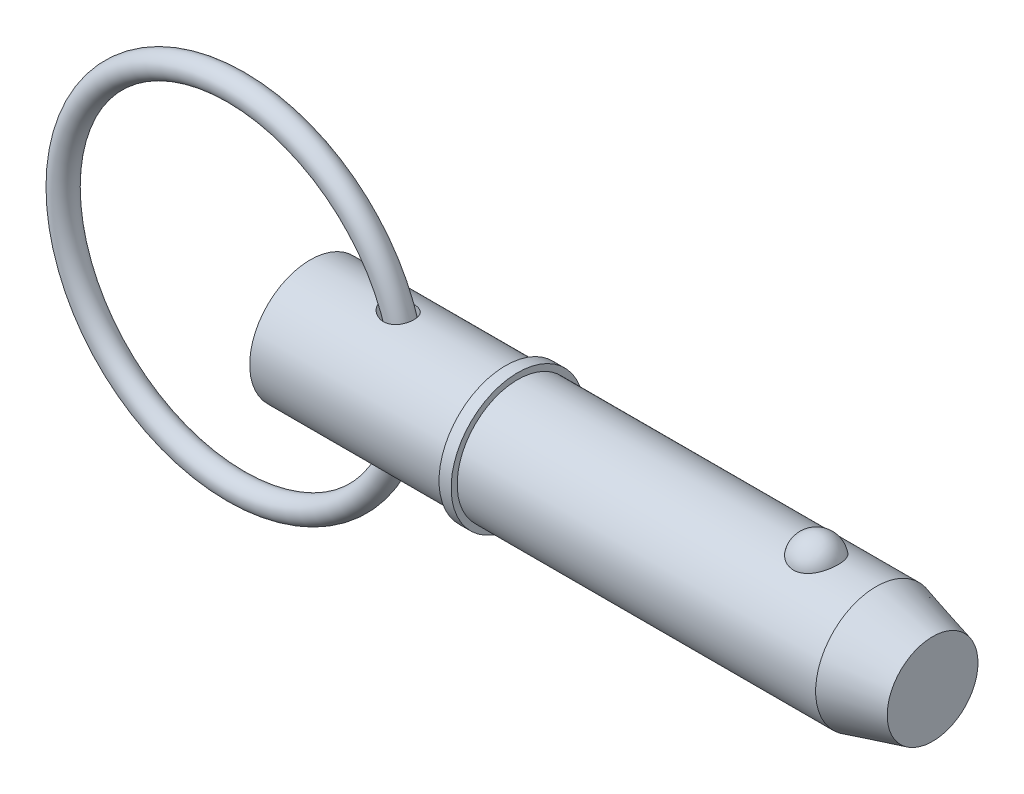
ISO-10303-21;
HEADER;
FILE_DESCRIPTION(('STEP AP214'),'2;1');
FILE_NAME('part.step','',(''),(''),'','','');
FILE_SCHEMA(('AUTOMOTIVE_DESIGN { 1 0 10303 214 1 1 1 1 }'));
ENDSEC;
DATA;
#1=APPLICATION_CONTEXT('core data for automotive mechanical design processes');
#2=APPLICATION_PROTOCOL_DEFINITION('international standard','automotive_design',2000,#1);
#3=PRODUCT_CONTEXT('',#1,'mechanical');
#4=PRODUCT('Part','Part','',(#3));
#5=PRODUCT_RELATED_PRODUCT_CATEGORY('part','',(#4));
#6=PRODUCT_DEFINITION_FORMATION('','',#4);
#7=PRODUCT_DEFINITION_CONTEXT('part definition',#1,'design');
#8=PRODUCT_DEFINITION('design','',#6,#7);
#9=PRODUCT_DEFINITION_SHAPE('','',#8);
#10=(LENGTH_UNIT() NAMED_UNIT(*) SI_UNIT(.MILLI.,.METRE.));
#11=(NAMED_UNIT(*) PLANE_ANGLE_UNIT() SI_UNIT($,.RADIAN.));
#12=(NAMED_UNIT(*) SI_UNIT($,.STERADIAN.) SOLID_ANGLE_UNIT());
#13=UNCERTAINTY_MEASURE_WITH_UNIT(LENGTH_MEASURE(1.E-05),#10,'distance_accuracy_value','');
#14=(GEOMETRIC_REPRESENTATION_CONTEXT(3) GLOBAL_UNCERTAINTY_ASSIGNED_CONTEXT((#13)) GLOBAL_UNIT_ASSIGNED_CONTEXT((#10,
#11,#12)) REPRESENTATION_CONTEXT('',''));
#15=CARTESIAN_POINT('',(0.,0.,0.));
#16=DIRECTION('',(0.,0.,1.));
#17=DIRECTION('',(1.,0.,0.));
#18=AXIS2_PLACEMENT_3D('',#15,#16,#17);
#19=CARTESIAN_POINT('',(-13.640845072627,0.,0.));
#20=DIRECTION('',(0.,0.,1.));
#21=DIRECTION('',(1.,0.,0.));
#22=AXIS2_PLACEMENT_3D('',#19,#20,#21);
#23=TOROIDAL_SURFACE('',#22,31.75,2.223);
#24=CARTESIAN_POINT('',(20.332154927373,0.,0.));
#25=VERTEX_POINT('',#24);
#26=VERTEX_LOOP('',#25);
#27=FACE_BOUND('',#26,.T.);
#28=ADVANCED_FACE('P0_F12',(#27),#23,.T.);
#29=CLOSED_SHELL('',(#28));
#30=MANIFOLD_SOLID_BREP('P0_B1',#29);
#31=CARTESIAN_POINT('',(0.,0.,0.));
#32=DIRECTION('',(1.,0.,0.));
#33=DIRECTION('',(0.,0.,-1.));
#34=AXIS2_PLACEMENT_3D('',#31,#32,#33);
#35=CYLINDRICAL_SURFACE('',#34,11.115);
#36=CARTESIAN_POINT('',(13.5245830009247,11.0328953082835,-1.34849772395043));
#37=CARTESIAN_POINT('',(13.6190616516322,11.0150940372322,-1.49413162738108));
#38=CARTESIAN_POINT('',(13.7272589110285,10.9954577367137,-1.63076546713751));
#39=CARTESIAN_POINT('',(13.9654537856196,10.9550099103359,-1.8834727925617));
#40=CARTESIAN_POINT('',(14.0954990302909,10.9341958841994,-1.99950019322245));
#41=CARTESIAN_POINT('',(14.3718600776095,10.893854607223,-2.20871939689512));
#42=CARTESIAN_POINT('',(14.5180879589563,10.8743212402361,-2.30202655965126));
#43=CARTESIAN_POINT('',(14.8233821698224,10.8385071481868,-2.46515115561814));
#44=CARTESIAN_POINT('',(14.9824448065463,10.8222254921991,-2.53497531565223));
#45=CARTESIAN_POINT('',(15.3233581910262,10.7936101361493,-2.65430007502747));
#46=CARTESIAN_POINT('',(15.5060064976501,10.7817126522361,-2.7016502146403));
#47=CARTESIAN_POINT('',(15.8771124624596,10.7657570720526,-2.76455948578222));
#48=CARTESIAN_POINT('',(16.0655695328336,10.7616981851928,-2.78012182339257));
#49=CARTESIAN_POINT('',(16.4345152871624,10.7624400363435,-2.77724928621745));
#50=CARTESIAN_POINT('',(16.6150121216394,10.7668823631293,-2.76018977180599));
#51=CARTESIAN_POINT('',(16.9695132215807,10.7837407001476,-2.69357457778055));
#52=CARTESIAN_POINT('',(17.1435222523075,10.7961507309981,-2.64404326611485));
#53=CARTESIAN_POINT('',(17.4621418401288,10.8258984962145,-2.51928348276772));
#54=CARTESIAN_POINT('',(17.6079677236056,10.8426430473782,-2.44700611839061));
#55=CARTESIAN_POINT('',(17.884162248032,10.8794194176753,-2.27791740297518));
#56=CARTESIAN_POINT('',(18.0145349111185,10.8994503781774,-2.18111245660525));
#57=CARTESIAN_POINT('',(18.2494965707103,10.9392822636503,-1.9713196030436));
#58=CARTESIAN_POINT('',(18.3550661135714,10.9590421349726,-1.85941863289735));
#59=CARTESIAN_POINT('',(18.5458147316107,10.9970986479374,-1.61919918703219));
#60=CARTESIAN_POINT('',(18.6309947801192,11.0153953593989,-1.49088149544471));
#61=CARTESIAN_POINT('',(18.7786686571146,11.0484675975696,-1.2218388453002));
#62=CARTESIAN_POINT('',(18.8412214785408,11.063252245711,-1.08114735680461));
#63=CARTESIAN_POINT('',(18.9425265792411,11.0877718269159,-0.791025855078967));
#64=CARTESIAN_POINT('',(18.9812780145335,11.0975065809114,-0.641595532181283));
#65=CARTESIAN_POINT('',(19.0343305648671,11.1109435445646,-0.336997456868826));
#66=CARTESIAN_POINT('',(19.0484404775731,11.1145985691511,-0.181794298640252));
#67=CARTESIAN_POINT('',(19.0513147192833,11.1153384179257,0.128864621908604));
#68=CARTESIAN_POINT('',(19.0400783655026,11.112423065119,0.284320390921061));
#69=CARTESIAN_POINT('',(18.9924362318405,11.1003163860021,0.591525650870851));
#70=CARTESIAN_POINT('',(18.9559600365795,11.0911075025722,0.743263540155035));
#71=CARTESIAN_POINT('',(18.858576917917,11.0673920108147,1.0382524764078));
#72=CARTESIAN_POINT('',(18.7976699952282,11.0528854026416,1.18150352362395));
#73=CARTESIAN_POINT('',(18.6529960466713,11.020201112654,1.45511394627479));
#74=CARTESIAN_POINT('',(18.5692772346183,11.0020311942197,1.58549973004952));
#75=CARTESIAN_POINT('',(18.3810003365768,10.9640237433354,1.82995492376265));
#76=CARTESIAN_POINT('',(18.2764441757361,10.9441863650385,1.94402583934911));
#77=CARTESIAN_POINT('',(18.0501398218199,10.9052267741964,2.15183128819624));
#78=CARTESIAN_POINT('',(17.9285270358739,10.8861003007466,2.24571250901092));
#79=CARTESIAN_POINT('',(17.6709592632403,10.8505244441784,2.41175942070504));
#80=CARTESIAN_POINT('',(17.5350055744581,10.8340748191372,2.48392707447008));
#81=CARTESIAN_POINT('',(17.2528390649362,10.8056099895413,2.60497667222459));
#82=CARTESIAN_POINT('',(17.1066353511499,10.7935909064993,2.65387899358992));
#83=CARTESIAN_POINT('',(16.8080326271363,10.7750969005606,2.72799859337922));
#84=CARTESIAN_POINT('',(16.6556326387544,10.7686228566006,2.75321211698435));
#85=CARTESIAN_POINT('',(16.3428877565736,10.761517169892,2.78086153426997));
#86=CARTESIAN_POINT('',(16.1824599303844,10.7611149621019,2.78240297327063));
#87=CARTESIAN_POINT('',(15.863296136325,10.766478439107,2.76156874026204));
#88=CARTESIAN_POINT('',(15.7045607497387,10.7722461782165,2.73918510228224));
#89=CARTESIAN_POINT('',(15.3787211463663,10.7898500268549,2.66904167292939));
#90=CARTESIAN_POINT('',(15.2120794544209,10.8021675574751,2.61925575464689));
#91=CARTESIAN_POINT('',(14.8886284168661,10.8315482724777,2.49496357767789));
#92=CARTESIAN_POINT('',(14.731827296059,10.8486153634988,2.42043695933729));
#93=CARTESIAN_POINT('',(14.4198762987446,10.8870804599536,2.24137362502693));
#94=CARTESIAN_POINT('',(14.2658484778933,10.9087148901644,2.13492229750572));
#95=CARTESIAN_POINT('',(13.9788214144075,10.9526299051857,1.89676517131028));
#96=CARTESIAN_POINT('',(13.8458041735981,10.9749099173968,1.76508120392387));
#97=CARTESIAN_POINT('',(13.6310853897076,11.012885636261,1.50762337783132));
#98=CARTESIAN_POINT('',(13.5444453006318,11.0290026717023,1.38602082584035));
#99=CARTESIAN_POINT('',(13.392158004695,11.0581740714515,1.12983363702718));
#100=CARTESIAN_POINT('',(13.3264946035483,11.0712307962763,0.995259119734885));
#101=CARTESIAN_POINT('',(13.2464179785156,11.0874250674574,0.785640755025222));
#102=CARTESIAN_POINT('',(13.2227369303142,11.0922707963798,0.714166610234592));
#103=CARTESIAN_POINT('',(13.1820656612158,11.1006486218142,0.569277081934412));
#104=CARTESIAN_POINT('',(13.1650721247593,11.1041813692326,0.495862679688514));
#105=CARTESIAN_POINT('',(13.1381118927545,11.1098070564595,0.347711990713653));
#106=CARTESIAN_POINT('',(13.1281436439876,11.1119003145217,0.272975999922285));
#107=CARTESIAN_POINT('',(13.1154243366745,11.1145746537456,0.122890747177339));
#108=CARTESIAN_POINT('',(13.1126723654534,11.1151559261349,0.0475415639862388));
#109=CARTESIAN_POINT('',(13.115160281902,11.1146296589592,-0.160384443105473));
#110=CARTESIAN_POINT('',(13.128061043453,11.111903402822,-0.292944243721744));
#111=CARTESIAN_POINT('',(13.175691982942,11.1019662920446,-0.553751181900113));
#112=CARTESIAN_POINT('',(13.2104121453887,11.094757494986,-0.682000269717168));
#113=CARTESIAN_POINT('',(13.2891255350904,11.0787645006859,-0.901873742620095));
#114=CARTESIAN_POINT('',(13.3290466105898,11.0707438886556,-0.995044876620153));
#115=CARTESIAN_POINT('',(13.4192915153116,11.0529876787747,-1.17599209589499));
#116=CARTESIAN_POINT('',(13.4696154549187,11.0432520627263,-1.26376812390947));
#117=CARTESIAN_POINT('',(13.5245830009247,11.0328953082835,-1.34849772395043));
#118=B_SPLINE_CURVE_WITH_KNOTS('',3,(#36,#37,#38,#39,#40,#41,#42,#43,#44,#45,#46,#47,#48,#49,
#50,#51,#52,#53,#54,#55,#56,#57,#58,#59,#60,#61,#62,#63,#64,#65,#66,#67,#68,#69,#70,#71,#72,#73,
#74,#75,#76,#77,#78,#79,#80,#81,#82,#83,#84,#85,#86,#87,#88,#89,#90,#91,#92,#93,#94,#95,#96,#97,
#98,#99,#100,#101,#102,#103,#104,#105,#106,#107,#108,#109,#110,#111,#112,#113,#114,#115,#116,
#117),.UNSPECIFIED.,.T.,.F.,(4,2,2,2,2,2,2,2,2,2,2,2,2,2,2,2,2,2,2,2,2,2,2,2,2,2,2,2,2,2,2,2,2,
2,2,2,2,2,2,2,4),(0.,0.52309976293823,1.04735506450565,1.56889024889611,2.09027590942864,
2.65465173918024,3.21897064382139,3.76002078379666,4.30066536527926,4.78898318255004,
5.27717362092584,5.74028268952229,6.20336964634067,6.665240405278,7.12712754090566,
7.59258295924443,8.05805091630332,8.52482272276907,8.99159451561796,9.45738731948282,
9.9231371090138,10.3853792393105,10.8475795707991,11.3093743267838,11.7712422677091,
12.2505208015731,12.7299589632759,13.2508366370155,13.7721440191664,14.334890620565,
14.8971525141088,15.3459336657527,15.7943675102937,16.0204422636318,16.2464047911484,
16.4723173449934,16.6982013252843,17.095711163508,17.4930386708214,17.7973741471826,
18.1017128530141),.UNSPECIFIED.);
#119=CARTESIAN_POINT('',(13.5245830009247,11.0328953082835,-1.34849772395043));
#120=VERTEX_POINT('',#119);
#121=EDGE_CURVE('P1_E42',#120,#120,#118,.T.);
#122=ORIENTED_EDGE('',*,*,#121,.T.);
#123=EDGE_LOOP('',(#122));
#124=FACE_BOUND('',#123,.T.);
#125=CARTESIAN_POINT('',(0.,0.,0.));
#126=DIRECTION('',(1.,0.,0.));
#127=DIRECTION('',(0.,0.,-1.));
#128=AXIS2_PLACEMENT_3D('',#125,#126,#127);
#129=CIRCLE('',#128,11.115);
#130=CARTESIAN_POINT('',(0.,0.,-11.115));
#131=VERTEX_POINT('',#130);
#132=EDGE_CURVE('P1_E9',#131,#131,#129,.T.);
#133=ORIENTED_EDGE('',*,*,#132,.T.);
#134=EDGE_LOOP('',(#133));
#135=FACE_BOUND('',#134,.T.);
#136=CARTESIAN_POINT('',(35.877,0.,0.));
#137=DIRECTION('',(1.,0.,0.));
#138=DIRECTION('',(0.,0.,-1.));
#139=AXIS2_PLACEMENT_3D('',#136,#137,#138);
#140=CIRCLE('',#139,11.115);
#141=CARTESIAN_POINT('',(35.877,0.,-11.115));
#142=VERTEX_POINT('',#141);
#143=EDGE_CURVE('P1_E25',#142,#142,#140,.T.);
#144=ORIENTED_EDGE('',*,*,#143,.F.);
#145=EDGE_LOOP('',(#144));
#146=FACE_BOUND('',#145,.T.);
#147=CARTESIAN_POINT('',(13.5245830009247,-11.0328953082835,-1.34849772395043));
#148=CARTESIAN_POINT('',(13.449887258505,-11.0469690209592,-1.233356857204));
#149=CARTESIAN_POINT('',(13.3837464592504,-11.0598986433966,-1.11255897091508));
#150=CARTESIAN_POINT('',(13.271526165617,-11.0822620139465,-0.861680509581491));
#151=CARTESIAN_POINT('',(13.2254273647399,-11.0916991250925,-0.731609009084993));
#152=CARTESIAN_POINT('',(13.1557497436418,-11.1060943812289,-0.464578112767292));
#153=CARTESIAN_POINT('',(13.1322820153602,-11.111030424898,-0.327588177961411));
#154=CARTESIAN_POINT('',(13.1098958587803,-11.1157368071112,-0.0515139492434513));
#155=CARTESIAN_POINT('',(13.1109730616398,-11.1155080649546,0.0875699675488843));
#156=CARTESIAN_POINT('',(13.1367722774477,-11.110088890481,0.354927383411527));
#157=CARTESIAN_POINT('',(13.160070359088,-11.1051972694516,0.483348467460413));
#158=CARTESIAN_POINT('',(13.2268311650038,-11.091413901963,0.734581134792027));
#159=CARTESIAN_POINT('',(13.2702981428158,-11.0825213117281,0.857391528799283));
#160=CARTESIAN_POINT('',(13.3769008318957,-11.0612491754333,1.09871322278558));
#161=CARTESIAN_POINT('',(13.4406446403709,-11.048763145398,1.21694419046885));
#162=CARTESIAN_POINT('',(13.5844860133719,-11.0215642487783,1.44267020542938));
#163=CARTESIAN_POINT('',(13.6645903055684,-11.0068504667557,1.55016080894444));
#164=CARTESIAN_POINT('',(13.8511803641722,-10.9741237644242,1.76795565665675));
#165=CARTESIAN_POINT('',(13.959808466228,-10.9559422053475,1.87639683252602));
#166=CARTESIAN_POINT('',(14.1916437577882,-10.9197998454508,2.07642617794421));
#167=CARTESIAN_POINT('',(14.3148607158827,-10.901839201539,2.16800294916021));
#168=CARTESIAN_POINT('',(14.5931107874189,-10.8649902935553,2.34622033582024));
#169=CARTESIAN_POINT('',(14.7501095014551,-10.8463937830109,2.42986679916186));
#170=CARTESIAN_POINT('',(15.0757118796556,-10.8136392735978,2.57171975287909));
#171=CARTESIAN_POINT('',(15.2443214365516,-10.7994835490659,2.62991321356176));
#172=CARTESIAN_POINT('',(15.599068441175,-10.7767894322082,2.72147498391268));
#173=CARTESIAN_POINT('',(15.7856559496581,-10.768622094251,2.75321798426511));
#174=CARTESIAN_POINT('',(16.1617095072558,-10.7608206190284,2.78356776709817));
#175=CARTESIAN_POINT('',(16.3511739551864,-10.7611818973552,2.78219235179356));
#176=CARTESIAN_POINT('',(16.7138126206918,-10.7705428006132,2.7457129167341));
#177=CARTESIAN_POINT('',(16.8872269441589,-10.7789612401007,2.71287798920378));
#178=CARTESIAN_POINT('',(17.2247245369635,-10.8028011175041,2.61632772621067));
#179=CARTESIAN_POINT('',(17.3888134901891,-10.8182182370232,2.55263143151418));
#180=CARTESIAN_POINT('',(17.6871641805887,-10.8524191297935,2.40281428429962));
#181=CARTESIAN_POINT('',(17.8227812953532,-10.8707652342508,2.31928155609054));
#182=CARTESIAN_POINT('',(18.0770765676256,-10.9094513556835,2.12988301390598));
#183=CARTESIAN_POINT('',(18.1957578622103,-10.9297910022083,2.0240213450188));
#184=CARTESIAN_POINT('',(18.4088055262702,-10.9693230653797,1.79719870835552));
#185=CARTESIAN_POINT('',(18.5038890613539,-10.9885305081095,1.67691225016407));
#186=CARTESIAN_POINT('',(18.6726701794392,-11.0244347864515,1.42183894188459));
#187=CARTESIAN_POINT('',(18.7463681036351,-11.0411316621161,1.28705232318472));
#188=CARTESIAN_POINT('',(18.8708297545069,-11.0702507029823,1.00634471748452));
#189=CARTESIAN_POINT('',(18.9215212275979,-11.0826593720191,0.860390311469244));
#190=CARTESIAN_POINT('',(18.9984973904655,-11.1017993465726,0.561823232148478));
#191=CARTESIAN_POINT('',(19.0247811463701,-11.1085304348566,0.409210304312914));
#192=CARTESIAN_POINT('',(19.0524622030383,-11.1156244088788,0.100537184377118));
#193=CARTESIAN_POINT('',(19.0536873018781,-11.1159432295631,-0.0555394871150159));
#194=CARTESIAN_POINT('',(19.0307837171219,-11.110065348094,-0.365700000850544));
#195=CARTESIAN_POINT('',(19.0066544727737,-11.1038685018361,-0.519783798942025));
#196=CARTESIAN_POINT('',(18.9335163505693,-11.0856111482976,-0.821817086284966));
#197=CARTESIAN_POINT('',(18.88447016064,-11.0735418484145,-0.969757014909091));
#198=CARTESIAN_POINT('',(18.7625929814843,-11.0448501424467,-1.25502066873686));
#199=CARTESIAN_POINT('',(18.6897623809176,-11.0282278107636,-1.39234456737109));
#200=CARTESIAN_POINT('',(18.522359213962,-10.9923333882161,-1.65195905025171));
#201=CARTESIAN_POINT('',(18.427863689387,-10.9730707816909,-1.77430060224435));
#202=CARTESIAN_POINT('',(18.2194216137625,-10.9340072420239,-2.00099176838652));
#203=CARTESIAN_POINT('',(18.1054772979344,-10.9142063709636,-2.10534344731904));
#204=CARTESIAN_POINT('',(17.8622613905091,-10.8764452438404,-2.2924289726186));
#205=CARTESIAN_POINT('',(17.7331196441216,-10.8584715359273,-2.3753290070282));
#206=CARTESIAN_POINT('',(17.4625069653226,-10.8261386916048,-2.51860389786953));
#207=CARTESIAN_POINT('',(17.3210365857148,-10.8117793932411,-2.57897976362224));
#208=CARTESIAN_POINT('',(17.0290309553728,-10.7880576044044,-2.67648805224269));
#209=CARTESIAN_POINT('',(16.8784484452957,-10.7787241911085,-2.71348542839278));
#210=CARTESIAN_POINT('',(16.573148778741,-10.7659618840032,-2.7636855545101));
#211=CARTESIAN_POINT('',(16.4184306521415,-10.7625343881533,-2.77688267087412));
#212=CARTESIAN_POINT('',(16.1008073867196,-10.761643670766,-2.78033419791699));
#213=CARTESIAN_POINT('',(15.9378898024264,-10.7644957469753,-2.76937572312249));
#214=CARTESIAN_POINT('',(15.6157286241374,-10.7762062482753,-2.72344300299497));
#215=CARTESIAN_POINT('',(15.4564861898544,-10.7850665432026,-2.68846128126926));
#216=CARTESIAN_POINT('',(15.1305734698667,-10.808737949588,-2.59174021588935));
#217=CARTESIAN_POINT('',(14.9645834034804,-10.8240246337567,-2.52782071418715));
#218=CARTESIAN_POINT('',(14.6448218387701,-10.8585969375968,-2.37491543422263));
#219=CARTESIAN_POINT('',(14.4910653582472,-10.8778873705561,-2.28589943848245));
#220=CARTESIAN_POINT('',(14.1837929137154,-10.920550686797,-2.07312951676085));
#221=CARTESIAN_POINT('',(14.0321999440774,-10.9441390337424,-1.94661563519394));
#222=CARTESIAN_POINT('',(13.756115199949,-10.9902311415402,-1.66673537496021));
#223=CARTESIAN_POINT('',(13.6315733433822,-11.0127368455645,-1.51341958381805));
#224=CARTESIAN_POINT('',(13.5245830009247,-11.0328953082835,-1.34849772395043));
#225=B_SPLINE_CURVE_WITH_KNOTS('',3,(#147,#148,#149,#150,#151,#152,#153,#154,#155,#156,#157,
#158,#159,#160,#161,#162,#163,#164,#165,#166,#167,#168,#169,#170,#171,#172,#173,#174,#175,#176,
#177,#178,#179,#180,#181,#182,#183,#184,#185,#186,#187,#188,#189,#190,#191,#192,#193,#194,#195,
#196,#197,#198,#199,#200,#201,#202,#203,#204,#205,#206,#207,#208,#209,#210,#211,#212,#213,#214,
#215,#216,#217,#218,#219,#220,#221,#222,#223,#224),.UNSPECIFIED.,.T.,.F.,(4,2,2,2,2,2,2,2,2,2,2,
2,2,2,2,2,2,2,2,2,2,2,2,2,2,2,2,2,2,2,2,2,2,2,2,2,2,2,4),(0.,0.4133945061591,0.8263899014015,
1.24140245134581,1.65634113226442,2.04635967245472,2.43646050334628,2.83958259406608,
3.24287078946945,3.70479277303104,4.16702582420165,4.70130512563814,5.23585761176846,
5.80123945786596,6.36631739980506,6.89348344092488,7.42032464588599,7.8989135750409,
8.37741373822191,8.83881993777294,9.30021877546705,9.76305681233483,10.2259125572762,
10.6919479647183,11.1579936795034,11.6247393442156,12.0914773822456,12.55658073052,
13.0216306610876,13.4829619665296,13.9442725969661,14.408224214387,14.8722856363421,
15.3601762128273,15.8482186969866,16.3815107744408,16.9154477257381,17.5086806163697,
18.1008056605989),.UNSPECIFIED.);
#226=CARTESIAN_POINT('',(13.5245830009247,-11.0328953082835,-1.34849772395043));
#227=VERTEX_POINT('',#226);
#228=EDGE_CURVE('P1_E17',#227,#227,#225,.T.);
#229=ORIENTED_EDGE('',*,*,#228,.T.);
#230=EDGE_LOOP('',(#229));
#231=FACE_BOUND('',#230,.T.);
#232=ADVANCED_FACE('P1_F13',(#124,#135,#146,#231),#35,.T.);
#233=CARTESIAN_POINT('',(0.,0.,0.));
#234=DIRECTION('',(1.,0.,0.));
#235=DIRECTION('',(0.,0.,-1.));
#236=AXIS2_PLACEMENT_3D('',#233,#234,#235);
#237=CYLINDRICAL_SURFACE('',#236,11.115);
#238=CARTESIAN_POINT('',(103.929563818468,0.,0.));
#239=DIRECTION('',(1.,0.,0.));
#240=DIRECTION('',(0.,0.,-1.));
#241=AXIS2_PLACEMENT_3D('',#238,#239,#240);
#242=CIRCLE('',#241,11.115);
#243=CARTESIAN_POINT('',(103.929563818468,0.,-11.115));
#244=VERTEX_POINT('',#243);
#245=EDGE_CURVE('P1_E99',#244,#244,#242,.T.);
#246=ORIENTED_EDGE('',*,*,#245,.F.);
#247=EDGE_LOOP('',(#246));
#248=FACE_BOUND('',#247,.T.);
#249=CARTESIAN_POINT('',(38.1,0.,0.));
#250=DIRECTION('',(1.,0.,0.));
#251=DIRECTION('',(0.,0.,-1.));
#252=AXIS2_PLACEMENT_3D('',#249,#250,#251);
#253=CIRCLE('',#252,11.115);
#254=CARTESIAN_POINT('',(38.1,0.,-11.115));
#255=VERTEX_POINT('',#254);
#256=EDGE_CURVE('P1_E96',#255,#255,#253,.T.);
#257=ORIENTED_EDGE('',*,*,#256,.T.);
#258=EDGE_LOOP('',(#257));
#259=FACE_BOUND('',#258,.T.);
#260=CARTESIAN_POINT('',(92.9310680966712,10.3028087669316,4.17077409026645));
#261=CARTESIAN_POINT('',(92.7147756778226,10.3028003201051,4.17078240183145));
#262=CARTESIAN_POINT('',(92.4985488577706,10.3098895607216,4.15340593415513));
#263=CARTESIAN_POINT('',(92.0725408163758,10.3373834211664,4.08449540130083));
#264=CARTESIAN_POINT('',(91.8627577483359,10.3577841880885,4.0329712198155));
#265=CARTESIAN_POINT('',(91.4557825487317,10.4095237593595,3.89746513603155));
#266=CARTESIAN_POINT('',(91.2585726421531,10.4408466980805,3.81353029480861));
#267=CARTESIAN_POINT('',(90.8813382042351,10.5110236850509,3.61560339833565));
#268=CARTESIAN_POINT('',(90.7013171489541,10.5498792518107,3.50160528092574));
#269=CARTESIAN_POINT('',(90.3576842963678,10.6322884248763,3.24292464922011));
#270=CARTESIAN_POINT('',(90.1946861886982,10.6759443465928,3.09746040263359));
#271=CARTESIAN_POINT('',(89.8945911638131,10.7625291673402,2.78171925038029));
#272=CARTESIAN_POINT('',(89.7574990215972,10.8054579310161,2.61143778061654));
#273=CARTESIAN_POINT('',(89.5064084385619,10.8881935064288,2.24226695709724));
#274=CARTESIAN_POINT('',(89.3937105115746,10.9277761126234,2.04244123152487));
#275=CARTESIAN_POINT('',(89.2017771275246,10.997484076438,1.62578254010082));
#276=CARTESIAN_POINT('',(89.1225446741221,11.0276085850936,1.40894804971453));
#277=CARTESIAN_POINT('',(88.9983034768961,11.0756732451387,0.961250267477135));
#278=CARTESIAN_POINT('',(88.953760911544,11.0934470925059,0.730239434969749));
#279=CARTESIAN_POINT('',(88.9015695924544,11.1143331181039,0.263439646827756));
#280=CARTESIAN_POINT('',(88.8939200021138,11.1174456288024,0.0276507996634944));
#281=CARTESIAN_POINT('',(88.9156105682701,11.1087161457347,-0.440729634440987));
#282=CARTESIAN_POINT('',(88.9447624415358,11.0969502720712,-0.673331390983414));
#283=CARTESIAN_POINT('',(89.0391432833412,11.0597872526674,-1.12996621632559));
#284=CARTESIAN_POINT('',(89.1043729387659,11.0343898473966,-1.35399912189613));
#285=CARTESIAN_POINT('',(89.2696984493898,10.972515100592,-1.78750286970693));
#286=CARTESIAN_POINT('',(89.3698386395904,10.9360236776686,-1.99695478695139));
#287=CARTESIAN_POINT('',(89.6029408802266,10.8557595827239,-2.3952066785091));
#288=CARTESIAN_POINT('',(89.7359054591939,10.8119863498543,-2.5840050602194));
#289=CARTESIAN_POINT('',(90.032407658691,10.7216733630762,-2.93635726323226));
#290=CARTESIAN_POINT('',(90.1960565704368,10.675123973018,-3.09981510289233));
#291=CARTESIAN_POINT('',(90.5498601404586,10.5846571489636,-3.39592247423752));
#292=CARTESIAN_POINT('',(90.7400123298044,10.5407394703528,-3.52857487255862));
#293=CARTESIAN_POINT('',(91.1375014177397,10.4616690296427,-3.75646057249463));
#294=CARTESIAN_POINT('',(91.3443670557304,10.4263443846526,-3.85245432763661));
#295=CARTESIAN_POINT('',(91.7729541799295,10.3675574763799,-4.00798747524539));
#296=CARTESIAN_POINT('',(91.994670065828,10.344090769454,-4.0675405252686));
#297=CARTESIAN_POINT('',(92.4346695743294,10.3128282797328,-4.14614314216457));
#298=CARTESIAN_POINT('',(92.6525654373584,10.3043040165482,-4.1670783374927));
#299=CARTESIAN_POINT('',(93.08894951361,10.3016771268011,-4.17357158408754));
#300=CARTESIAN_POINT('',(93.3074376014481,10.3075716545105,-4.15913661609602));
#301=CARTESIAN_POINT('',(93.7317442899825,10.3326686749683,-4.09636961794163));
#302=CARTESIAN_POINT('',(93.9377458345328,10.3514555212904,-4.0490957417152));
#303=CARTESIAN_POINT('',(94.3385764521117,10.399818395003,-3.92320197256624));
#304=CARTESIAN_POINT('',(94.5334046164,10.4293952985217,-3.84457953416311));
#305=CARTESIAN_POINT('',(94.9111917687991,10.4969600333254,-3.65612410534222));
#306=CARTESIAN_POINT('',(95.0937974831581,10.5351178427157,-3.54564545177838));
#307=CARTESIAN_POINT('',(95.4382040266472,10.6154999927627,-3.29718036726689));
#308=CARTESIAN_POINT('',(95.600000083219,10.657725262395,-3.15918764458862));
#309=CARTESIAN_POINT('',(95.9069596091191,10.744212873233,-2.85163580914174));
#310=CARTESIAN_POINT('',(96.0508919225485,10.7884718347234,-2.68084605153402));
#311=CARTESIAN_POINT('',(96.3092371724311,10.872374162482,-2.3172186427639));
#312=CARTESIAN_POINT('',(96.4236448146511,10.9120167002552,-2.12437704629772));
#313=CARTESIAN_POINT('',(96.6238739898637,10.9838919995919,-1.71516999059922));
#314=CARTESIAN_POINT('',(96.7086617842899,11.0158465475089,-1.498248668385));
#315=CARTESIAN_POINT('',(96.8426838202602,11.0673523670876,-1.05228572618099));
#316=CARTESIAN_POINT('',(96.8919174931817,11.086903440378,-0.823243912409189));
#317=CARTESIAN_POINT('',(96.9538915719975,11.1116323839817,-0.359087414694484));
#318=CARTESIAN_POINT('',(96.9665662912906,11.1167843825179,-0.123962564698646));
#319=CARTESIAN_POINT('',(96.954973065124,11.1121144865,0.345220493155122));
#320=CARTESIAN_POINT('',(96.9307056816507,11.1022928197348,0.579278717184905));
#321=CARTESIAN_POINT('',(96.8459073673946,11.0687504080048,1.03866534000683));
#322=CARTESIAN_POINT('',(96.7855299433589,11.0450885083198,1.26402641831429));
#323=CARTESIAN_POINT('',(96.6298532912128,10.9863185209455,1.70076772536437));
#324=CARTESIAN_POINT('',(96.534551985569,10.9512097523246,1.91214712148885));
#325=CARTESIAN_POINT('',(96.3103974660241,10.8729733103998,2.31608359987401));
#326=CARTESIAN_POINT('',(96.1813806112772,10.8298068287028,2.50854240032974));
#327=CARTESIAN_POINT('',(95.8927327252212,10.7401896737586,2.86808766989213));
#328=CARTESIAN_POINT('',(95.7331022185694,10.6937390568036,3.03517457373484));
#329=CARTESIAN_POINT('',(95.3875341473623,10.6029321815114,3.33857581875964));
#330=CARTESIAN_POINT('',(95.2017089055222,10.5585680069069,3.47501541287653));
#331=CARTESIAN_POINT('',(94.8078750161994,10.4769321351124,3.71390897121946));
#332=CARTESIAN_POINT('',(94.5998635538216,10.439661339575,3.81635861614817));
#333=CARTESIAN_POINT('',(94.1540666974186,10.3749407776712,3.98910631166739));
#334=CARTESIAN_POINT('',(93.9152342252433,10.3482457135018,4.05700929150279));
#335=CARTESIAN_POINT('',(93.4279254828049,10.312188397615,4.14782844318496));
#336=CARTESIAN_POINT('',(93.1794535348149,10.3028184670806,4.17076454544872));
#337=CARTESIAN_POINT('',(92.9310680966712,10.3028087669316,4.17077409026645));
#338=B_SPLINE_CURVE_WITH_KNOTS('',3,(#260,#261,#262,#263,#264,#265,#266,#267,#268,#269,#270,
#271,#272,#273,#274,#275,#276,#277,#278,#279,#280,#281,#282,#283,#284,#285,#286,#287,#288,#289,
#290,#291,#292,#293,#294,#295,#296,#297,#298,#299,#300,#301,#302,#303,#304,#305,#306,#307,#308,
#309,#310,#311,#312,#313,#314,#315,#316,#317,#318,#319,#320,#321,#322,#323,#324,#325,#326,#327,
#328,#329,#330,#331,#332,#333,#334,#335,#336,#337),.UNSPECIFIED.,.T.,.F.,(4,2,2,2,2,2,2,2,2,2,2,
2,2,2,2,2,2,2,2,2,2,2,2,2,2,2,2,2,2,2,2,2,2,2,2,2,2,2,4),(0.,0.647966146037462,1.29574482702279,
1.94258643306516,2.58955857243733,3.25496465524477,3.92049326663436,4.61566368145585,
5.3108964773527,6.01531821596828,6.71972398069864,7.42054043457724,8.12137023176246,
8.82309331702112,9.52487047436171,10.2292439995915,10.9335519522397,11.6223330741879,
12.3108558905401,12.9647664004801,13.6185478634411,14.2521847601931,14.8858731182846,
15.5334360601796,16.1811472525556,16.8611459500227,17.5412664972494,18.2431855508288,
18.9451158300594,19.6483065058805,20.3514864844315,21.0516982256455,21.7519516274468,
22.4556690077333,23.1593743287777,23.8601491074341,24.5610129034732,25.3054529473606,
26.049562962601),.UNSPECIFIED.);
#339=CARTESIAN_POINT('',(92.9310680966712,10.3028087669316,4.17077409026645));
#340=VERTEX_POINT('',#339);
#341=EDGE_CURVE('P1_E34',#340,#340,#338,.T.);
#342=ORIENTED_EDGE('',*,*,#341,.T.);
#343=EDGE_LOOP('',(#342));
#344=FACE_BOUND('',#343,.T.);
#345=ADVANCED_FACE('P1_F46',(#248,#259,#344),#237,.T.);
#346=CARTESIAN_POINT('',(0.,0.,0.));
#347=DIRECTION('',(-1.,0.,0.));
#348=DIRECTION('',(0.,0.,1.));
#349=AXIS2_PLACEMENT_3D('',#346,#347,#348);
#350=PLANE('',#349);
#351=ORIENTED_EDGE('',*,*,#132,.F.);
#352=EDGE_LOOP('',(#351));
#353=FACE_BOUND('',#352,.T.);
#354=ADVANCED_FACE('P1_F15',(#353),#350,.T.);
#355=CARTESIAN_POINT('',(35.877,11.115,0.));
#356=DIRECTION('',(-1.,0.,0.));
#357=DIRECTION('',(0.,0.,1.));
#358=AXIS2_PLACEMENT_3D('',#355,#356,#357);
#359=PLANE('',#358);
#360=ORIENTED_EDGE('',*,*,#143,.T.);
#361=EDGE_LOOP('',(#360));
#362=FACE_BOUND('',#361,.T.);
#363=CARTESIAN_POINT('',(35.877,0.,0.));
#364=DIRECTION('',(1.,0.,0.));
#365=DIRECTION('',(0.,0.,-1.));
#366=AXIS2_PLACEMENT_3D('',#363,#364,#365);
#367=CIRCLE('',#366,12.2265);
#368=CARTESIAN_POINT('',(35.877,0.,-12.2265));
#369=VERTEX_POINT('',#368);
#370=EDGE_CURVE('P1_E30',#369,#369,#367,.T.);
#371=ORIENTED_EDGE('',*,*,#370,.F.);
#372=EDGE_LOOP('',(#371));
#373=FACE_BOUND('',#372,.T.);
#374=ADVANCED_FACE('P1_F81',(#362,#373),#359,.T.);
#375=CARTESIAN_POINT('',(0.,0.,0.));
#376=DIRECTION('',(1.,0.,0.));
#377=DIRECTION('',(0.,0.,-1.));
#378=AXIS2_PLACEMENT_3D('',#375,#376,#377);
#379=CYLINDRICAL_SURFACE('',#378,12.2265);
#380=ORIENTED_EDGE('',*,*,#370,.T.);
#381=EDGE_LOOP('',(#380));
#382=FACE_BOUND('',#381,.T.);
#383=CARTESIAN_POINT('',(38.1,0.,0.));
#384=DIRECTION('',(1.,0.,0.));
#385=DIRECTION('',(0.,0.,-1.));
#386=AXIS2_PLACEMENT_3D('',#383,#384,#385);
#387=CIRCLE('',#386,12.2265);
#388=CARTESIAN_POINT('',(38.1,0.,-12.2265));
#389=VERTEX_POINT('',#388);
#390=EDGE_CURVE('P1_E95',#389,#389,#387,.T.);
#391=ORIENTED_EDGE('',*,*,#390,.F.);
#392=EDGE_LOOP('',(#391));
#393=FACE_BOUND('',#392,.T.);
#394=ADVANCED_FACE('P1_F68',(#382,#393),#379,.T.);
#395=CARTESIAN_POINT('',(38.1,12.2265,0.));
#396=DIRECTION('',(1.,0.,0.));
#397=DIRECTION('',(0.,0.,-1.));
#398=AXIS2_PLACEMENT_3D('',#395,#396,#397);
#399=PLANE('',#398);
#400=ORIENTED_EDGE('',*,*,#390,.T.);
#401=EDGE_LOOP('',(#400));
#402=FACE_BOUND('',#401,.T.);
#403=ORIENTED_EDGE('',*,*,#256,.F.);
#404=EDGE_LOOP('',(#403));
#405=FACE_BOUND('',#404,.T.);
#406=ADVANCED_FACE('P1_F62',(#402,#405),#399,.T.);
#407=CARTESIAN_POINT('',(114.3,0.,0.));
#408=DIRECTION('',(-1.,0.,0.));
#409=DIRECTION('',(0.,0.,1.));
#410=AXIS2_PLACEMENT_3D('',#407,#408,#409);
#411=CONICAL_SURFACE('',#410,8.33625000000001,0.26179938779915);
#412=ORIENTED_EDGE('',*,*,#245,.T.);
#413=EDGE_LOOP('',(#412));
#414=FACE_BOUND('',#413,.T.);
#415=CARTESIAN_POINT('',(114.3,0.,0.));
#416=DIRECTION('',(1.,0.,0.));
#417=DIRECTION('',(0.,0.,-1.));
#418=AXIS2_PLACEMENT_3D('',#415,#416,#417);
#419=CIRCLE('',#418,8.33625000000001);
#420=CARTESIAN_POINT('',(114.3,0.,-8.33625000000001));
#421=VERTEX_POINT('',#420);
#422=EDGE_CURVE('P1_E41',#421,#421,#419,.T.);
#423=ORIENTED_EDGE('',*,*,#422,.F.);
#424=EDGE_LOOP('',(#423));
#425=FACE_BOUND('',#424,.T.);
#426=ADVANCED_FACE('P1_F59',(#414,#425),#411,.T.);
#427=CARTESIAN_POINT('',(114.3,8.33625000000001,0.));
#428=DIRECTION('',(1.,0.,0.));
#429=DIRECTION('',(0.,0.,-1.));
#430=AXIS2_PLACEMENT_3D('',#427,#428,#429);
#431=PLANE('',#430);
#432=ORIENTED_EDGE('',*,*,#422,.T.);
#433=EDGE_LOOP('',(#432));
#434=FACE_BOUND('',#433,.T.);
#435=ADVANCED_FACE('P1_F55',(#434),#431,.T.);
#436=CARTESIAN_POINT('',(92.9310680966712,10.0035,0.));
#437=DIRECTION('',(-1.,0.,0.));
#438=DIRECTION('',(0.,1.,0.));
#439=AXIS2_PLACEMENT_3D('',#436,#437,#438);
#440=SPHERICAL_SURFACE('',#439,4.18150000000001);
#441=ORIENTED_EDGE('',*,*,#341,.F.);
#442=EDGE_LOOP('',(#441));
#443=FACE_BOUND('',#442,.T.);
#444=ADVANCED_FACE('P1_F50',(#443),#440,.T.);
#445=CARTESIAN_POINT('',(-13.640845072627,0.,0.));
#446=DIRECTION('',(0.,0.,1.));
#447=DIRECTION('',(1.,0.,0.));
#448=AXIS2_PLACEMENT_3D('',#445,#446,#447);
#449=TOROIDAL_SURFACE('',#448,31.75,2.77875);
#450=ORIENTED_EDGE('',*,*,#228,.F.);
#451=EDGE_LOOP('',(#450));
#452=FACE_BOUND('',#451,.T.);
#453=ORIENTED_EDGE('',*,*,#121,.F.);
#454=EDGE_LOOP('',(#453));
#455=FACE_BOUND('',#454,.T.);
#456=ADVANCED_FACE('P1_F54',(#452,#455),#449,.F.);
#457=CLOSED_SHELL('',(#232,#345,#354,#374,#394,#406,#426,#435,#444,#456));
#458=MANIFOLD_SOLID_BREP('P1_B1',#457);
#459=ADVANCED_BREP_SHAPE_REPRESENTATION('',(#18,#30,#458),#14);
#460=SHAPE_DEFINITION_REPRESENTATION(#9,#459);
ENDSEC;
END-ISO-10303-21;
